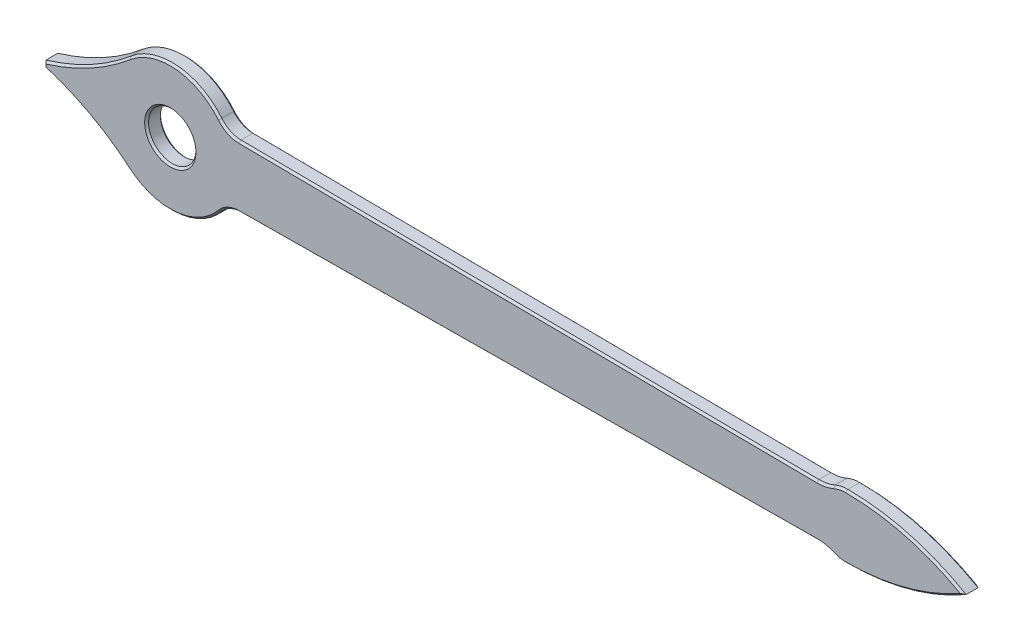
from build123d import *

# Parameters (mm, degrees)
SKETCH_1_R      = 3
EXTRUDE_1_DEPTH = 2
CHAMFER_1_SIZE  = 0.25


with BuildPart() as part:
    # Sketch 1 → Extrude 1 (new body)
    with BuildSketch(Plane.XY):
        with BuildLine():
            Line((81.948645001, 3.3), (8.719721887, 3.93905913))
            ThreePointArc((8.719721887, 3.93905913), (7.371062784, 4.252777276), (6.284183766, 5.110678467))
            ThreePointArc((6.284183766, 5.110678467), (0.753367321, 8.064889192), (-5.228910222, 6.186153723))
            ThreePointArc((-5.228910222, 6.186153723), (-10.31373188, 2.715294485), (-16, 0.3555))
            Line((-16, 0.3555), (-16, -0.3555))
            ThreePointArc((-16, -0.3555), (-10.31373188, -2.715294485), (-5.228910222, -6.186153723))
            ThreePointArc((-5.228910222, -6.186153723), (0.753367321, -8.064889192), (6.284183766, -5.110678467))
            ThreePointArc((6.284183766, -5.110678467), (7.371062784, -4.252777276), (8.719721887, -3.93905913))
            Line((8.719721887, -3.93905913), (81.948645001, -3.3))
            ThreePointArc((81.948645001, -3.3), (82.988834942, -3.400128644), (83.985494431, -3.714279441))
            ThreePointArc((83.985494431, -3.714279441), (84.775479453, -3.965181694), (85.6, -4.05))
            ThreePointArc((85.6, -4.05), (93.36856647, -3.01969063), (100.6, 0))
            ThreePointArc((100.6, 0), (93.36856647, 3.01969063), (85.6, 4.05))
            ThreePointArc((85.6, 4.05), (84.775479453, 3.965181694), (83.985494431, 3.714279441))
            ThreePointArc((83.985494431, 3.714279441), (82.988834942, 3.400128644), (81.948645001, 3.3))
        make_face()
        Circle(SKETCH_1_R, mode=Mode.SUBTRACT)
    extrude(amount=EXTRUDE_1_DEPTH)

    # Chamfer 1
    chamfer_1_edges = [part.edges().sort_by_distance(p)[0] for p in [
        (84.775479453, 3.965181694, 2),
        (82.988834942, 3.400128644, 2),
        (84.775479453, -3.965181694, 0),
        (82.988834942, -3.400128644, 0),
        (45.334183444, -3.619529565, 0),
        (7.371062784, -4.252777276, 0),
        (0.753367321, -8.064889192, 0),
        (-10.31373188, -2.715294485, 0),
        (-16, 0, 0),
        (45.334183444, 3.619529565, 2),
        (-10.31373188, 2.715294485, 0),
        (0.753367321, 8.064889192, 0),
        (7.371062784, 4.252777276, 0),
        (45.334183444, 3.619529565, 0),
        (82.988834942, 3.400128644, 0),
        (84.775479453, 3.965181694, 0),
        (93.36856647, 3.01969063, 0),
        (93.36856647, -3.01969063, 0),
        (7.371062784, 4.252777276, 2),
        (0.753367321, 8.064889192, 2),
        (-10.31373188, 2.715294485, 2),
        (-16, 0, 2),
        (-10.31373188, -2.715294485, 2),
        (0.753367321, -8.064889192, 2),
        (-3, 0, 0),
        (-3, 0, 2),
        (7.371062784, -4.252777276, 2),
        (93.36856647, -3.01969063, 2),
        (45.334183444, -3.619529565, 2),
        (82.988834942, -3.400128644, 2),
        (84.775479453, -3.965181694, 2),
        (93.36856647, 3.01969063, 2),
    ]]
    chamfer(chamfer_1_edges, length=CHAMFER_1_SIZE)


solid = part.part
